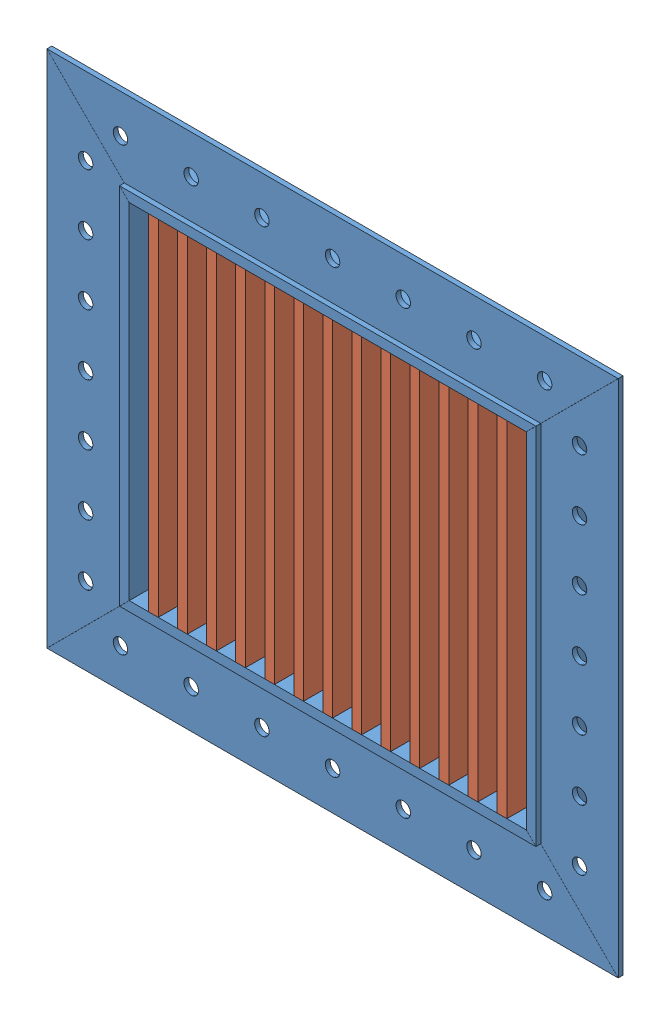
SolidWorks assembly 518 - 1.SLDASM, configuration Default (file format 11000). Lengths in mm.
Overall size (187.33 170.18 19.05).
11 component instances, 4 part files, 30 mates.
Components (placement in the parent):
- Standard AG10 I Frame-1: Standard AG10 I Frame.SLDPRT [Default] at (-7.447 -13.27 12.9451) size (187.32 170.18 19.05)
- Standard AG10 Core-1: Standard AG10 Core.SLDPRT [Default] at (-7.447 -13.27 12.9451) x (-1 0 0) z (0 1 0) size (130.18 19.05 113.03)
- Wall_1-1: Wall_1.SLDPRT [Default] at (-7.4495 -13.27 10.5651) x (-1 0 0) z (0 1 0) (suppressed, hidden)
- Typical Dry Wall Screw-1: Typical Dry Wall Screw.SLDPRT [Default] at (38.908 -85.66 19.2951) x (1 0 0) z (0 -1 0) (suppressed, hidden)
- Typical Dry Wall Screw-2: Typical Dry Wall Screw.SLDPRT [Default] at (73.5155 -72.96 19.2951) x (1 0 0) z (0 -1 0) (suppressed, hidden)
- Typical Dry Wall Screw-3: Typical Dry Wall Screw.SLDPRT [Default] at (62.0855 59.12 19.2951) x (1 0 0) z (0 -1 0) (suppressed, hidden)
- Typical Dry Wall Screw-4: Typical Dry Wall Screw.SLDPRT [Default] at (73.5155 26.5234 19.2951) x (1 0 0) z (0 -1 0) (suppressed, hidden)
- Typical Dry Wall Screw-5: Typical Dry Wall Screw.SLDPRT [Default] at (-88.4095 46.42 19.2951) x (1 0 0) z (0 -1 0) (suppressed, hidden)
- Typical Dry Wall Screw-6: Typical Dry Wall Screw.SLDPRT [Default] at (-53.802 59.12 19.2951) x (1 0 0) z (0 -1 0) (suppressed, hidden)
- Typical Dry Wall Screw-7: Typical Dry Wall Screw.SLDPRT [Default] at (-88.4095 -53.0633 19.2951) x (1 0 0) z (0 -1 0) (suppressed, hidden)
- Typical Dry Wall Screw-8: Typical Dry Wall Screw.SLDPRT [Default] at (-76.9795 -85.66 19.2951) x (1 0 0) z (0 -1 0) (suppressed, hidden)
Mates (geometry in assembly coordinates):
- Coincident1: coincident: plane of assembly; plane of assembly; plane of Standard AG10 I Frame-1 through (-7.447 -13.27 3.4201) normal (0 0 -1); plane of Standard AG10 Core-1 through (-7.447 -13.27 3.4201) normal (0 0 -1)
- Coincident2: coincident: plane of assembly; plane of assembly; plane of Standard AG10 I Frame-1 through (57.6405 43.245 22.4701) normal (-1 0 0); plane of Standard AG10 Core-1 through (57.6405 34.355 16.1201) normal (1 0 0)
- Coincident3: coincident: plane of assembly; plane of assembly; plane of Standard AG10 I Frame-1 through (-72.5345 -69.785 22.4701) normal (0 1 0); plane of Standard AG10 Core-1 through (-63.0095 -69.785 22.4701) normal (0 -1 0)
- Coincident4: coincident: plane of assembly; plane of assembly; plane of Standard AG10 I Frame-1 through (-7.447 -13.27 3.4201) normal (0 0 -1); plane of Wall_1-1 through (-7.4495 -13.27 3.4201) normal (0 0 -1)
- Coincident5: coincident: plane of assembly; plane of assembly; plane of Standard AG10 I Frame-1 through (-75.7095 -72.96 22.4701) normal (0 -1 0); plane of Wall_1-1 through (60.8155 -72.96 17.7101) normal (0 1 0)
- Coincident6: coincident: plane of assembly; plane of assembly; plane of Standard AG10 I Frame-1 through (60.8155 46.42 22.4701) normal (1 0 0); plane of Wall_1-1 through (60.8155 -72.96 17.7101) normal (-1 0 0)
- Concentric1: concentric: cylinder of assembly; cylinder of assembly; cylinder of Standard AG10 I Frame-1 through (38.908 -85.66 10.9724) axis (0 0 1) radius 2.3813; cylinder of Typical Dry Wall Screw-1 through (38.908 -85.66 19.2951) axis (0 0 1) radius 1.905
- Coincident7: coincident: plane of assembly; circle of assembly; plane of Standard AG10 I Frame-1 through (-7.447 -13.27 19.2951) normal (0 0 1); circle of Typical Dry Wall Screw-1
- Parallel1: parallel: plane of assembly; plane of assembly; plane of Standard AG10 I Frame-1 through (-101.1095 -98.36 17.7076) normal (0 -1 0); plane of Typical Dry Wall Screw-1 through (38.527 -86.041 19.8031) normal (0 1 0)
- Concentric2: concentric: cylinder of assembly; cylinder of assembly; cylinder of Standard AG10 I Frame-1 through (73.5155 -72.96 10.9724) axis (0 0 1) radius 2.3813; cylinder of Typical Dry Wall Screw-2 through (73.5155 -72.96 19.2951) axis (0 0 1) radius 3.81
- Coincident9: coincident: plane of assembly; plane of assembly; plane of Typical Dry Wall Screw-1 through (35.098 -85.66 20.3111) normal (0 0 1); plane of Typical Dry Wall Screw-2 through (69.7055 -72.96 20.3111) normal (0 0 1)
- Parallel2: parallel: plane of assembly; plane of assembly; plane of Standard AG10 I Frame-1 through (-72.5345 -69.785 22.4701) normal (0 1 0); plane of Typical Dry Wall Screw-2 through (73.1345 -73.341 19.8031) normal (0 1 0)
- Coincident11: coincident: plane of assembly; plane of assembly; plane of Typical Dry Wall Screw-2 through (69.7055 -72.96 20.3111) normal (0 0 1); plane of Typical Dry Wall Screw-8 through (-80.7895 -85.66 20.3111) normal (0 0 1)
- Coincident12: coincident: plane of assembly; plane of assembly; plane of Typical Dry Wall Screw-7 through (-92.2195 -53.0633 20.3111) normal (0 0 1); plane of Typical Dry Wall Screw-8 through (-80.7895 -85.66 20.3111) normal (0 0 1)
- Coincident13: coincident: plane of assembly; plane of assembly; plane of Typical Dry Wall Screw-2 through (69.7055 -72.96 20.3111) normal (0 0 1); plane of Typical Dry Wall Screw-3 through (58.2755 59.12 20.3111) normal (0 0 1)
- Coincident14: coincident: plane of assembly; plane of assembly; plane of Typical Dry Wall Screw-4 through (69.7055 26.5234 20.3111) normal (0 0 1); plane of Typical Dry Wall Screw-6 through (-57.612 59.12 20.3111) normal (0 0 1)
- Coincident15: coincident: plane of assembly; plane of assembly; plane of Typical Dry Wall Screw-5 through (-92.2195 46.42 20.3111) normal (0 0 1); plane of Typical Dry Wall Screw-6 through (-57.612 59.12 20.3111) normal (0 0 1)
- Coincident16: coincident: plane of assembly; plane of assembly; plane of Typical Dry Wall Screw-3 through (58.2755 59.12 20.3111) normal (0 0 1); plane of Typical Dry Wall Screw-4 through (69.7055 26.5234 20.3111) normal (0 0 1)
- Concentric3: concentric: cylinder of assembly; cylinder of assembly; cylinder of Standard AG10 I Frame-1 through (73.5155 26.5234 10.9724) axis (0 0 1) radius 2.3813; cylinder of Typical Dry Wall Screw-4 through (73.5155 26.5234 19.2951) axis (0 0 1) radius 3.81
- Concentric4: concentric: cylinder of assembly; cylinder of assembly; cylinder of Standard AG10 I Frame-1 through (62.0855 59.12 10.9724) axis (0 0 1) radius 2.3813; cylinder of Typical Dry Wall Screw-3 through (62.0855 59.12 19.2951) axis (0 0 1) radius 3.81
- Concentric5: concentric: cylinder of assembly; cylinder of assembly; cylinder of Standard AG10 I Frame-1 through (-53.802 59.12 10.9724) axis (0 0 1) radius 2.3813; cylinder of Typical Dry Wall Screw-6 through (-53.802 59.12 19.2951) axis (0 0 1) radius 3.81
- Concentric6: concentric: cylinder of assembly; cylinder of assembly; cylinder of Standard AG10 I Frame-1 through (-88.4095 46.42 10.9724) axis (0 0 1) radius 2.3813; cylinder of Typical Dry Wall Screw-5 through (-88.4095 46.42 19.2951) axis (0 0 1) radius 3.81
- Concentric7: concentric: cylinder of assembly; cylinder of assembly; cylinder of Standard AG10 I Frame-1 through (-76.9795 -85.66 10.9724) axis (0 0 1) radius 2.3813; cylinder of Typical Dry Wall Screw-8 through (-76.9795 -85.66 19.2951) axis (0 0 1) radius 3.81
- Concentric8: concentric: cylinder of assembly; cylinder of assembly; cylinder of Standard AG10 I Frame-1 through (-88.4095 -53.0633 10.9724) axis (0 0 1) radius 2.3813; cylinder of Typical Dry Wall Screw-7 through (-88.4095 -53.0633 19.2951) axis (0 0 1) radius 3.81
- Parallel4: parallel: plane of assembly; plane of assembly; plane of Standard AG10 I Frame-1 through (-72.5345 -69.785 22.4701) normal (0 1 0); plane of Typical Dry Wall Screw-7 through (-88.7905 -53.4443 19.8031) normal (0 1 0)
- Parallel5: parallel: plane of assembly; plane of assembly; plane of Standard AG10 I Frame-1 through (-72.5345 -69.785 22.4701) normal (0 1 0); plane of Typical Dry Wall Screw-8 through (-77.3605 -87.946 19.8031) normal (0 1 0)
- Parallel6: parallel: plane of assembly; plane of assembly; plane of Standard AG10 I Frame-1 through (-75.7095 46.42 22.4701) normal (0 1 0); plane of Typical Dry Wall Screw-3 through (61.7045 56.834 19.8031) normal (0 1 0)
- Parallel7: parallel: plane of assembly; plane of assembly; plane of Standard AG10 I Frame-1 through (-75.7095 46.42 22.4701) normal (0 1 0); plane of Typical Dry Wall Screw-6 through (-54.183 56.834 19.8031) normal (0 1 0)
- Parallel8: parallel: plane of assembly; plane of assembly; plane of Standard AG10 I Frame-1 through (-75.7095 46.42 22.4701) normal (0 1 0); plane of Typical Dry Wall Screw-5 through (-88.7905 44.134 19.8031) normal (0 1 0)
- Parallel9: parallel: plane of assembly; plane of assembly; plane of Standard AG10 I Frame-1 through (-75.7095 46.42 22.4701) normal (0 1 0); plane of Typical Dry Wall Screw-4 through (73.1345 24.2374 19.8031) normal (0 1 0)
